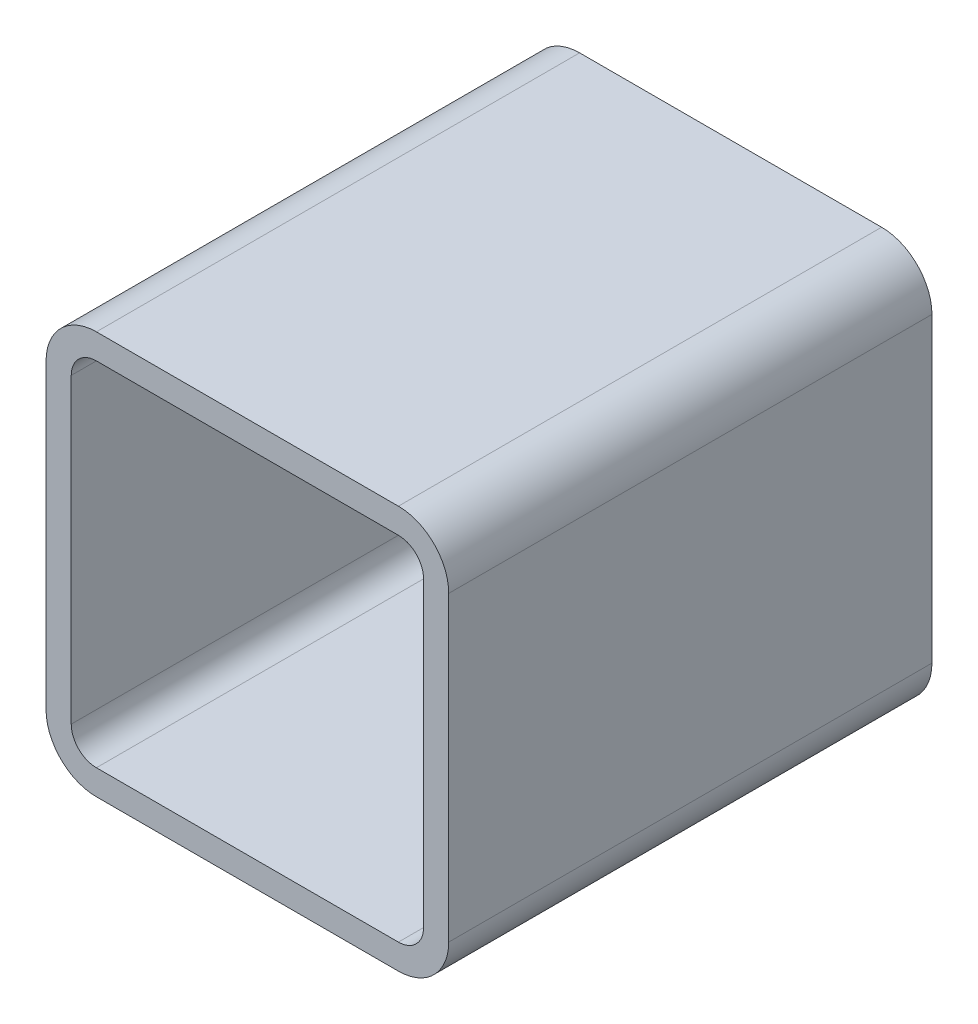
ISO-10303-21;
HEADER;
FILE_DESCRIPTION(('STEP AP214'),'2;1');
FILE_NAME('part.step','',(''),(''),'','','');
FILE_SCHEMA(('AUTOMOTIVE_DESIGN { 1 0 10303 214 1 1 1 1 }'));
ENDSEC;
DATA;
#1=APPLICATION_CONTEXT('core data for automotive mechanical design processes');
#2=APPLICATION_PROTOCOL_DEFINITION('international standard','automotive_design',2000,#1);
#3=PRODUCT_CONTEXT('',#1,'mechanical');
#4=PRODUCT('Part','Part','',(#3));
#5=PRODUCT_RELATED_PRODUCT_CATEGORY('part','',(#4));
#6=PRODUCT_DEFINITION_FORMATION('','',#4);
#7=PRODUCT_DEFINITION_CONTEXT('part definition',#1,'design');
#8=PRODUCT_DEFINITION('design','',#6,#7);
#9=PRODUCT_DEFINITION_SHAPE('','',#8);
#10=(LENGTH_UNIT() NAMED_UNIT(*) SI_UNIT(.MILLI.,.METRE.));
#11=(NAMED_UNIT(*) PLANE_ANGLE_UNIT() SI_UNIT($,.RADIAN.));
#12=(NAMED_UNIT(*) SI_UNIT($,.STERADIAN.) SOLID_ANGLE_UNIT());
#13=UNCERTAINTY_MEASURE_WITH_UNIT(LENGTH_MEASURE(1.E-05),#10,'distance_accuracy_value','');
#14=(GEOMETRIC_REPRESENTATION_CONTEXT(3) GLOBAL_UNCERTAINTY_ASSIGNED_CONTEXT((#13)) GLOBAL_UNIT_ASSIGNED_CONTEXT((#10,
#11,#12)) REPRESENTATION_CONTEXT('',''));
#15=CARTESIAN_POINT('',(0.,0.,0.));
#16=DIRECTION('',(0.,0.,1.));
#17=DIRECTION('',(1.,0.,0.));
#18=AXIS2_PLACEMENT_3D('',#15,#16,#17);
#19=CARTESIAN_POINT('',(34.4845794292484,224.170313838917,304.8));
#20=DIRECTION('',(0.,0.,1.));
#21=DIRECTION('',(1.,0.,0.));
#22=AXIS2_PLACEMENT_3D('',#19,#20,#21);
#23=PLANE('',#22);
#24=CARTESIAN_POINT('',(34.4845794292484,224.170313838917,304.8));
#25=DIRECTION('',(0.,0.,1.));
#26=DIRECTION('',(1.,0.,0.));
#27=AXIS2_PLACEMENT_3D('',#24,#25,#26);
#28=CIRCLE('',#27,31.75);
#29=CARTESIAN_POINT('',(34.4845794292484,255.920313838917,304.8));
#30=VERTEX_POINT('',#29);
#31=CARTESIAN_POINT('',(2.73457942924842,224.170313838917,304.8));
#32=VERTEX_POINT('',#31);
#33=EDGE_CURVE('E211',#30,#32,#28,.T.);
#34=ORIENTED_EDGE('',*,*,#33,.T.);
#35=DIRECTION('',(0.,-1.,0.));
#36=VECTOR('',#35,1.);
#37=CARTESIAN_POINT('',(2.73457942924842,33.6703138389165,304.8));
#38=LINE('',#37,#36);
#39=CARTESIAN_POINT('',(2.73457942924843,33.6703138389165,304.8));
#40=VERTEX_POINT('',#39);
#41=EDGE_CURVE('E214',#32,#40,#38,.T.);
#42=ORIENTED_EDGE('',*,*,#41,.T.);
#43=CARTESIAN_POINT('',(34.4845794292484,33.6703138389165,304.8));
#44=DIRECTION('',(0.,0.,1.));
#45=DIRECTION('',(1.,0.,0.));
#46=AXIS2_PLACEMENT_3D('',#43,#44,#45);
#47=CIRCLE('',#46,31.75);
#48=CARTESIAN_POINT('',(34.4845794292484,1.92031383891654,304.8));
#49=VERTEX_POINT('',#48);
#50=EDGE_CURVE('E217',#40,#49,#47,.T.);
#51=ORIENTED_EDGE('',*,*,#50,.T.);
#52=DIRECTION('',(1.,0.,0.));
#53=VECTOR('',#52,1.);
#54=CARTESIAN_POINT('',(224.984579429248,1.92031383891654,304.8));
#55=LINE('',#54,#53);
#56=CARTESIAN_POINT('',(224.984579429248,1.92031383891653,304.8));
#57=VERTEX_POINT('',#56);
#58=EDGE_CURVE('E219',#49,#57,#55,.T.);
#59=ORIENTED_EDGE('',*,*,#58,.T.);
#60=CARTESIAN_POINT('',(224.984579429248,33.6703138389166,304.8));
#61=DIRECTION('',(0.,0.,1.));
#62=DIRECTION('',(1.,0.,0.));
#63=AXIS2_PLACEMENT_3D('',#60,#61,#62);
#64=CIRCLE('',#63,31.75);
#65=CARTESIAN_POINT('',(256.734579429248,33.6703138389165,304.8));
#66=VERTEX_POINT('',#65);
#67=EDGE_CURVE('E221',#57,#66,#64,.T.);
#68=ORIENTED_EDGE('',*,*,#67,.T.);
#69=DIRECTION('',(0.,1.,0.));
#70=VECTOR('',#69,1.);
#71=CARTESIAN_POINT('',(256.734579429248,224.170313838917,304.8));
#72=LINE('',#71,#70);
#73=CARTESIAN_POINT('',(256.734579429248,224.170313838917,304.8));
#74=VERTEX_POINT('',#73);
#75=EDGE_CURVE('E223',#66,#74,#72,.T.);
#76=ORIENTED_EDGE('',*,*,#75,.T.);
#77=CARTESIAN_POINT('',(224.984579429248,224.170313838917,304.8));
#78=DIRECTION('',(0.,0.,1.));
#79=DIRECTION('',(1.,0.,0.));
#80=AXIS2_PLACEMENT_3D('',#77,#78,#79);
#81=CIRCLE('',#80,31.75);
#82=CARTESIAN_POINT('',(224.984579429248,255.920313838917,304.8));
#83=VERTEX_POINT('',#82);
#84=EDGE_CURVE('E225',#74,#83,#81,.T.);
#85=ORIENTED_EDGE('',*,*,#84,.T.);
#86=DIRECTION('',(-1.,0.,0.));
#87=VECTOR('',#86,1.);
#88=CARTESIAN_POINT('',(34.4845794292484,255.920313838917,304.8));
#89=LINE('',#88,#87);
#90=EDGE_CURVE('E227',#83,#30,#89,.T.);
#91=ORIENTED_EDGE('',*,*,#90,.T.);
#92=EDGE_LOOP('',(#34,#42,#51,#59,#68,#76,#85,#91));
#93=FACE_BOUND('',#92,.T.);
#94=DIRECTION('',(0.,-1.,0.));
#95=VECTOR('',#94,1.);
#96=CARTESIAN_POINT('',(18.6095794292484,33.6703138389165,304.8));
#97=LINE('',#96,#95);
#98=CARTESIAN_POINT('',(18.6095794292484,224.170313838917,304.8));
#99=VERTEX_POINT('',#98);
#100=CARTESIAN_POINT('',(18.6095794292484,33.6703138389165,304.8));
#101=VERTEX_POINT('',#100);
#102=EDGE_CURVE('E154',#99,#101,#97,.T.);
#103=ORIENTED_EDGE('',*,*,#102,.F.);
#104=CARTESIAN_POINT('',(34.4845794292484,224.170313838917,304.8));
#105=DIRECTION('',(0.,0.,1.));
#106=DIRECTION('',(1.,0.,0.));
#107=AXIS2_PLACEMENT_3D('',#104,#105,#106);
#108=CIRCLE('',#107,15.875);
#109=CARTESIAN_POINT('',(34.4845794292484,240.045313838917,304.8));
#110=VERTEX_POINT('',#109);
#111=EDGE_CURVE('E146',#110,#99,#108,.T.);
#112=ORIENTED_EDGE('',*,*,#111,.F.);
#113=DIRECTION('',(-1.,0.,0.));
#114=VECTOR('',#113,1.);
#115=CARTESIAN_POINT('',(34.4845794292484,240.045313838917,304.8));
#116=LINE('',#115,#114);
#117=CARTESIAN_POINT('',(224.984579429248,240.045313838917,304.8));
#118=VERTEX_POINT('',#117);
#119=EDGE_CURVE('E179',#118,#110,#116,.T.);
#120=ORIENTED_EDGE('',*,*,#119,.F.);
#121=CARTESIAN_POINT('',(224.984579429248,224.170313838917,304.8));
#122=DIRECTION('',(0.,0.,1.));
#123=DIRECTION('',(1.,0.,0.));
#124=AXIS2_PLACEMENT_3D('',#121,#122,#123);
#125=CIRCLE('',#124,15.875);
#126=CARTESIAN_POINT('',(240.859579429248,224.170313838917,304.8));
#127=VERTEX_POINT('',#126);
#128=EDGE_CURVE('E177',#127,#118,#125,.T.);
#129=ORIENTED_EDGE('',*,*,#128,.F.);
#130=DIRECTION('',(0.,1.,0.));
#131=VECTOR('',#130,1.);
#132=CARTESIAN_POINT('',(240.859579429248,224.170313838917,304.8));
#133=LINE('',#132,#131);
#134=CARTESIAN_POINT('',(240.859579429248,33.6703138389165,304.8));
#135=VERTEX_POINT('',#134);
#136=EDGE_CURVE('E175',#135,#127,#133,.T.);
#137=ORIENTED_EDGE('',*,*,#136,.F.);
#138=CARTESIAN_POINT('',(224.984579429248,33.6703138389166,304.8));
#139=DIRECTION('',(0.,0.,1.));
#140=DIRECTION('',(1.,0.,0.));
#141=AXIS2_PLACEMENT_3D('',#138,#139,#140);
#142=CIRCLE('',#141,15.875);
#143=CARTESIAN_POINT('',(224.984579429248,17.7953138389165,304.8));
#144=VERTEX_POINT('',#143);
#145=EDGE_CURVE('E173',#144,#135,#142,.T.);
#146=ORIENTED_EDGE('',*,*,#145,.F.);
#147=DIRECTION('',(1.,0.,0.));
#148=VECTOR('',#147,1.);
#149=CARTESIAN_POINT('',(224.984579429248,17.7953138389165,304.8));
#150=LINE('',#149,#148);
#151=CARTESIAN_POINT('',(34.4845794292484,17.7953138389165,304.8));
#152=VERTEX_POINT('',#151);
#153=EDGE_CURVE('E169',#152,#144,#150,.T.);
#154=ORIENTED_EDGE('',*,*,#153,.F.);
#155=CARTESIAN_POINT('',(34.4845794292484,33.6703138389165,304.8));
#156=DIRECTION('',(0.,0.,1.));
#157=DIRECTION('',(1.,0.,0.));
#158=AXIS2_PLACEMENT_3D('',#155,#156,#157);
#159=CIRCLE('',#158,15.875);
#160=EDGE_CURVE('E167',#101,#152,#159,.T.);
#161=ORIENTED_EDGE('',*,*,#160,.F.);
#162=EDGE_LOOP('',(#103,#112,#120,#129,#137,#146,#154,#161));
#163=FACE_BOUND('',#162,.T.);
#164=ADVANCED_FACE('F33',(#93,#163),#23,.T.);
#165=CARTESIAN_POINT('',(34.4845794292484,224.170313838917,0.));
#166=DIRECTION('',(0.,0.,1.));
#167=DIRECTION('',(1.,0.,0.));
#168=AXIS2_PLACEMENT_3D('',#165,#166,#167);
#169=PLANE('',#168);
#170=CARTESIAN_POINT('',(34.4845794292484,224.170313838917,0.));
#171=DIRECTION('',(0.,0.,1.));
#172=DIRECTION('',(1.,0.,0.));
#173=AXIS2_PLACEMENT_3D('',#170,#171,#172);
#174=CIRCLE('',#173,31.75);
#175=CARTESIAN_POINT('',(34.4845794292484,255.920313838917,0.));
#176=VERTEX_POINT('',#175);
#177=CARTESIAN_POINT('',(2.73457942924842,224.170313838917,0.));
#178=VERTEX_POINT('',#177);
#179=EDGE_CURVE('E162',#176,#178,#174,.T.);
#180=ORIENTED_EDGE('',*,*,#179,.F.);
#181=DIRECTION('',(-1.,0.,0.));
#182=VECTOR('',#181,1.);
#183=CARTESIAN_POINT('',(34.4845794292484,255.920313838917,0.));
#184=LINE('',#183,#182);
#185=CARTESIAN_POINT('',(224.984579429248,255.920313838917,0.));
#186=VERTEX_POINT('',#185);
#187=EDGE_CURVE('E215',#186,#176,#184,.T.);
#188=ORIENTED_EDGE('',*,*,#187,.F.);
#189=CARTESIAN_POINT('',(224.984579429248,224.170313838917,0.));
#190=DIRECTION('',(0.,0.,1.));
#191=DIRECTION('',(1.,0.,0.));
#192=AXIS2_PLACEMENT_3D('',#189,#190,#191);
#193=CIRCLE('',#192,31.75);
#194=CARTESIAN_POINT('',(256.734579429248,224.170313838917,0.));
#195=VERTEX_POINT('',#194);
#196=EDGE_CURVE('E242',#195,#186,#193,.T.);
#197=ORIENTED_EDGE('',*,*,#196,.F.);
#198=DIRECTION('',(0.,1.,0.));
#199=VECTOR('',#198,1.);
#200=CARTESIAN_POINT('',(256.734579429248,224.170313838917,0.));
#201=LINE('',#200,#199);
#202=CARTESIAN_POINT('',(256.734579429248,33.6703138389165,0.));
#203=VERTEX_POINT('',#202);
#204=EDGE_CURVE('E240',#203,#195,#201,.T.);
#205=ORIENTED_EDGE('',*,*,#204,.F.);
#206=CARTESIAN_POINT('',(224.984579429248,33.6703138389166,0.));
#207=DIRECTION('',(0.,0.,1.));
#208=DIRECTION('',(1.,0.,0.));
#209=AXIS2_PLACEMENT_3D('',#206,#207,#208);
#210=CIRCLE('',#209,31.75);
#211=CARTESIAN_POINT('',(224.984579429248,1.92031383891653,0.));
#212=VERTEX_POINT('',#211);
#213=EDGE_CURVE('E238',#212,#203,#210,.T.);
#214=ORIENTED_EDGE('',*,*,#213,.F.);
#215=DIRECTION('',(1.,0.,0.));
#216=VECTOR('',#215,1.);
#217=CARTESIAN_POINT('',(224.984579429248,1.92031383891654,0.));
#218=LINE('',#217,#216);
#219=CARTESIAN_POINT('',(34.4845794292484,1.92031383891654,0.));
#220=VERTEX_POINT('',#219);
#221=EDGE_CURVE('E236',#220,#212,#218,.T.);
#222=ORIENTED_EDGE('',*,*,#221,.F.);
#223=CARTESIAN_POINT('',(34.4845794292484,33.6703138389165,0.));
#224=DIRECTION('',(0.,0.,1.));
#225=DIRECTION('',(1.,0.,0.));
#226=AXIS2_PLACEMENT_3D('',#223,#224,#225);
#227=CIRCLE('',#226,31.75);
#228=CARTESIAN_POINT('',(2.73457942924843,33.6703138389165,0.));
#229=VERTEX_POINT('',#228);
#230=EDGE_CURVE('E234',#229,#220,#227,.T.);
#231=ORIENTED_EDGE('',*,*,#230,.F.);
#232=DIRECTION('',(0.,-1.,0.));
#233=VECTOR('',#232,1.);
#234=CARTESIAN_POINT('',(2.73457942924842,33.6703138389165,0.));
#235=LINE('',#234,#233);
#236=EDGE_CURVE('E232',#178,#229,#235,.T.);
#237=ORIENTED_EDGE('',*,*,#236,.F.);
#238=EDGE_LOOP('',(#180,#188,#197,#205,#214,#222,#231,#237));
#239=FACE_BOUND('',#238,.T.);
#240=CARTESIAN_POINT('',(34.4845794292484,224.170313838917,0.));
#241=DIRECTION('',(0.,0.,1.));
#242=DIRECTION('',(1.,0.,0.));
#243=AXIS2_PLACEMENT_3D('',#240,#241,#242);
#244=CIRCLE('',#243,15.875);
#245=CARTESIAN_POINT('',(34.4845794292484,240.045313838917,0.));
#246=VERTEX_POINT('',#245);
#247=CARTESIAN_POINT('',(18.6095794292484,224.170313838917,0.));
#248=VERTEX_POINT('',#247);
#249=EDGE_CURVE('E56',#246,#248,#244,.T.);
#250=ORIENTED_EDGE('',*,*,#249,.T.);
#251=DIRECTION('',(0.,-1.,0.));
#252=VECTOR('',#251,1.);
#253=CARTESIAN_POINT('',(18.6095794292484,33.6703138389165,0.));
#254=LINE('',#253,#252);
#255=CARTESIAN_POINT('',(18.6095794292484,33.6703138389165,0.));
#256=VERTEX_POINT('',#255);
#257=EDGE_CURVE('E161',#248,#256,#254,.T.);
#258=ORIENTED_EDGE('',*,*,#257,.T.);
#259=CARTESIAN_POINT('',(34.4845794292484,33.6703138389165,0.));
#260=DIRECTION('',(0.,0.,1.));
#261=DIRECTION('',(1.,0.,0.));
#262=AXIS2_PLACEMENT_3D('',#259,#260,#261);
#263=CIRCLE('',#262,15.875);
#264=CARTESIAN_POINT('',(34.4845794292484,17.7953138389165,0.));
#265=VERTEX_POINT('',#264);
#266=EDGE_CURVE('E183',#256,#265,#263,.T.);
#267=ORIENTED_EDGE('',*,*,#266,.T.);
#268=DIRECTION('',(1.,0.,0.));
#269=VECTOR('',#268,1.);
#270=CARTESIAN_POINT('',(224.984579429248,17.7953138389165,0.));
#271=LINE('',#270,#269);
#272=CARTESIAN_POINT('',(224.984579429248,17.7953138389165,0.));
#273=VERTEX_POINT('',#272);
#274=EDGE_CURVE('E186',#265,#273,#271,.T.);
#275=ORIENTED_EDGE('',*,*,#274,.T.);
#276=CARTESIAN_POINT('',(224.984579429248,33.6703138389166,0.));
#277=DIRECTION('',(0.,0.,1.));
#278=DIRECTION('',(1.,0.,0.));
#279=AXIS2_PLACEMENT_3D('',#276,#277,#278);
#280=CIRCLE('',#279,15.875);
#281=CARTESIAN_POINT('',(240.859579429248,33.6703138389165,0.));
#282=VERTEX_POINT('',#281);
#283=EDGE_CURVE('E189',#273,#282,#280,.T.);
#284=ORIENTED_EDGE('',*,*,#283,.T.);
#285=DIRECTION('',(0.,1.,0.));
#286=VECTOR('',#285,1.);
#287=CARTESIAN_POINT('',(240.859579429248,224.170313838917,0.));
#288=LINE('',#287,#286);
#289=CARTESIAN_POINT('',(240.859579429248,224.170313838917,0.));
#290=VERTEX_POINT('',#289);
#291=EDGE_CURVE('E192',#282,#290,#288,.T.);
#292=ORIENTED_EDGE('',*,*,#291,.T.);
#293=CARTESIAN_POINT('',(224.984579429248,224.170313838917,0.));
#294=DIRECTION('',(0.,0.,1.));
#295=DIRECTION('',(1.,0.,0.));
#296=AXIS2_PLACEMENT_3D('',#293,#294,#295);
#297=CIRCLE('',#296,15.875);
#298=CARTESIAN_POINT('',(224.984579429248,240.045313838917,0.));
#299=VERTEX_POINT('',#298);
#300=EDGE_CURVE('E195',#290,#299,#297,.T.);
#301=ORIENTED_EDGE('',*,*,#300,.T.);
#302=DIRECTION('',(-1.,0.,0.));
#303=VECTOR('',#302,1.);
#304=CARTESIAN_POINT('',(34.4845794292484,240.045313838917,0.));
#305=LINE('',#304,#303);
#306=EDGE_CURVE('E155',#299,#246,#305,.T.);
#307=ORIENTED_EDGE('',*,*,#306,.T.);
#308=EDGE_LOOP('',(#250,#258,#267,#275,#284,#292,#301,#307));
#309=FACE_BOUND('',#308,.T.);
#310=ADVANCED_FACE('F272',(#239,#309),#169,.F.);
#311=CARTESIAN_POINT('',(34.4845794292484,224.170313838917,304.8));
#312=DIRECTION('',(0.,0.,-1.));
#313=DIRECTION('',(-1.,0.,0.));
#314=AXIS2_PLACEMENT_3D('',#311,#312,#313);
#315=CYLINDRICAL_SURFACE('',#314,31.75);
#316=ORIENTED_EDGE('',*,*,#179,.T.);
#317=DIRECTION('',(0.,0.,-1.));
#318=VECTOR('',#317,1.);
#319=CARTESIAN_POINT('',(2.73457942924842,224.170313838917,304.8));
#320=LINE('',#319,#318);
#321=EDGE_CURVE('E11',#32,#178,#320,.T.);
#322=ORIENTED_EDGE('',*,*,#321,.F.);
#323=ORIENTED_EDGE('',*,*,#33,.F.);
#324=DIRECTION('',(0.,0.,-1.));
#325=VECTOR('',#324,1.);
#326=CARTESIAN_POINT('',(34.4845794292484,255.920313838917,304.8));
#327=LINE('',#326,#325);
#328=EDGE_CURVE('E229',#30,#176,#327,.T.);
#329=ORIENTED_EDGE('',*,*,#328,.T.);
#330=EDGE_LOOP('',(#316,#322,#323,#329));
#331=FACE_BOUND('',#330,.T.);
#332=ADVANCED_FACE('F35',(#331),#315,.T.);
#333=CARTESIAN_POINT('',(2.73457942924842,33.6703138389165,304.8));
#334=DIRECTION('',(1.,0.,0.));
#335=DIRECTION('',(0.,0.,-1.));
#336=AXIS2_PLACEMENT_3D('',#333,#334,#335);
#337=PLANE('',#336);
#338=ORIENTED_EDGE('',*,*,#236,.T.);
#339=DIRECTION('',(0.,0.,-1.));
#340=VECTOR('',#339,1.);
#341=CARTESIAN_POINT('',(2.73457942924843,33.6703138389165,304.8));
#342=LINE('',#341,#340);
#343=EDGE_CURVE('E41',#40,#229,#342,.T.);
#344=ORIENTED_EDGE('',*,*,#343,.F.);
#345=ORIENTED_EDGE('',*,*,#41,.F.);
#346=ORIENTED_EDGE('',*,*,#321,.T.);
#347=EDGE_LOOP('',(#338,#344,#345,#346));
#348=FACE_BOUND('',#347,.T.);
#349=ADVANCED_FACE('F289',(#348),#337,.F.);
#350=CARTESIAN_POINT('',(34.4845794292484,33.6703138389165,304.8));
#351=DIRECTION('',(0.,0.,-1.));
#352=DIRECTION('',(-1.,0.,0.));
#353=AXIS2_PLACEMENT_3D('',#350,#351,#352);
#354=CYLINDRICAL_SURFACE('',#353,31.75);
#355=ORIENTED_EDGE('',*,*,#230,.T.);
#356=DIRECTION('',(0.,0.,-1.));
#357=VECTOR('',#356,1.);
#358=CARTESIAN_POINT('',(34.4845794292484,1.92031383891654,304.8));
#359=LINE('',#358,#357);
#360=EDGE_CURVE('E259',#49,#220,#359,.T.);
#361=ORIENTED_EDGE('',*,*,#360,.F.);
#362=ORIENTED_EDGE('',*,*,#50,.F.);
#363=ORIENTED_EDGE('',*,*,#343,.T.);
#364=EDGE_LOOP('',(#355,#361,#362,#363));
#365=FACE_BOUND('',#364,.T.);
#366=ADVANCED_FACE('F266',(#365),#354,.T.);
#367=CARTESIAN_POINT('',(224.984579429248,1.92031383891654,304.8));
#368=DIRECTION('',(0.,1.,0.));
#369=DIRECTION('',(0.,0.,1.));
#370=AXIS2_PLACEMENT_3D('',#367,#368,#369);
#371=PLANE('',#370);
#372=ORIENTED_EDGE('',*,*,#221,.T.);
#373=DIRECTION('',(0.,0.,-1.));
#374=VECTOR('',#373,1.);
#375=CARTESIAN_POINT('',(224.984579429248,1.92031383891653,304.8));
#376=LINE('',#375,#374);
#377=EDGE_CURVE('E256',#57,#212,#376,.T.);
#378=ORIENTED_EDGE('',*,*,#377,.F.);
#379=ORIENTED_EDGE('',*,*,#58,.F.);
#380=ORIENTED_EDGE('',*,*,#360,.T.);
#381=EDGE_LOOP('',(#372,#378,#379,#380));
#382=FACE_BOUND('',#381,.T.);
#383=ADVANCED_FACE('F278',(#382),#371,.F.);
#384=CARTESIAN_POINT('',(224.984579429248,33.6703138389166,304.8));
#385=DIRECTION('',(0.,0.,-1.));
#386=DIRECTION('',(-1.,0.,0.));
#387=AXIS2_PLACEMENT_3D('',#384,#385,#386);
#388=CYLINDRICAL_SURFACE('',#387,31.75);
#389=ORIENTED_EDGE('',*,*,#213,.T.);
#390=DIRECTION('',(0.,0.,-1.));
#391=VECTOR('',#390,1.);
#392=CARTESIAN_POINT('',(256.734579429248,33.6703138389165,304.8));
#393=LINE('',#392,#391);
#394=EDGE_CURVE('E253',#66,#203,#393,.T.);
#395=ORIENTED_EDGE('',*,*,#394,.F.);
#396=ORIENTED_EDGE('',*,*,#67,.F.);
#397=ORIENTED_EDGE('',*,*,#377,.T.);
#398=EDGE_LOOP('',(#389,#395,#396,#397));
#399=FACE_BOUND('',#398,.T.);
#400=ADVANCED_FACE('F282',(#399),#388,.T.);
#401=CARTESIAN_POINT('',(256.734579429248,224.170313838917,304.8));
#402=DIRECTION('',(-1.,0.,0.));
#403=DIRECTION('',(0.,0.,1.));
#404=AXIS2_PLACEMENT_3D('',#401,#402,#403);
#405=PLANE('',#404);
#406=ORIENTED_EDGE('',*,*,#204,.T.);
#407=DIRECTION('',(0.,0.,-1.));
#408=VECTOR('',#407,1.);
#409=CARTESIAN_POINT('',(256.734579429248,224.170313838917,304.8));
#410=LINE('',#409,#408);
#411=EDGE_CURVE('E250',#74,#195,#410,.T.);
#412=ORIENTED_EDGE('',*,*,#411,.F.);
#413=ORIENTED_EDGE('',*,*,#75,.F.);
#414=ORIENTED_EDGE('',*,*,#394,.T.);
#415=EDGE_LOOP('',(#406,#412,#413,#414));
#416=FACE_BOUND('',#415,.T.);
#417=ADVANCED_FACE('F302',(#416),#405,.F.);
#418=CARTESIAN_POINT('',(224.984579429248,224.170313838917,304.8));
#419=DIRECTION('',(0.,0.,-1.));
#420=DIRECTION('',(-1.,0.,0.));
#421=AXIS2_PLACEMENT_3D('',#418,#419,#420);
#422=CYLINDRICAL_SURFACE('',#421,31.75);
#423=ORIENTED_EDGE('',*,*,#196,.T.);
#424=DIRECTION('',(0.,0.,-1.));
#425=VECTOR('',#424,1.);
#426=CARTESIAN_POINT('',(224.984579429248,255.920313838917,304.8));
#427=LINE('',#426,#425);
#428=EDGE_CURVE('E247',#83,#186,#427,.T.);
#429=ORIENTED_EDGE('',*,*,#428,.F.);
#430=ORIENTED_EDGE('',*,*,#84,.F.);
#431=ORIENTED_EDGE('',*,*,#411,.T.);
#432=EDGE_LOOP('',(#423,#429,#430,#431));
#433=FACE_BOUND('',#432,.T.);
#434=ADVANCED_FACE('F300',(#433),#422,.T.);
#435=CARTESIAN_POINT('',(34.4845794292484,255.920313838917,304.8));
#436=DIRECTION('',(0.,-1.,0.));
#437=DIRECTION('',(0.,0.,-1.));
#438=AXIS2_PLACEMENT_3D('',#435,#436,#437);
#439=PLANE('',#438);
#440=ORIENTED_EDGE('',*,*,#187,.T.);
#441=ORIENTED_EDGE('',*,*,#328,.F.);
#442=ORIENTED_EDGE('',*,*,#90,.F.);
#443=ORIENTED_EDGE('',*,*,#428,.T.);
#444=EDGE_LOOP('',(#440,#441,#442,#443));
#445=FACE_BOUND('',#444,.T.);
#446=ADVANCED_FACE('F295',(#445),#439,.F.);
#447=CARTESIAN_POINT('',(34.4845794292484,224.170313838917,304.8));
#448=DIRECTION('',(0.,0.,-1.));
#449=DIRECTION('',(-1.,0.,0.));
#450=AXIS2_PLACEMENT_3D('',#447,#448,#449);
#451=CYLINDRICAL_SURFACE('',#450,15.875);
#452=ORIENTED_EDGE('',*,*,#249,.F.);
#453=DIRECTION('',(0.,0.,-1.));
#454=VECTOR('',#453,1.);
#455=CARTESIAN_POINT('',(34.4845794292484,240.045313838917,304.8));
#456=LINE('',#455,#454);
#457=EDGE_CURVE('E150',#110,#246,#456,.T.);
#458=ORIENTED_EDGE('',*,*,#457,.F.);
#459=ORIENTED_EDGE('',*,*,#111,.T.);
#460=DIRECTION('',(0.,0.,-1.));
#461=VECTOR('',#460,1.);
#462=CARTESIAN_POINT('',(18.6095794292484,224.170313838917,304.8));
#463=LINE('',#462,#461);
#464=EDGE_CURVE('E149',#99,#248,#463,.T.);
#465=ORIENTED_EDGE('',*,*,#464,.T.);
#466=EDGE_LOOP('',(#452,#458,#459,#465));
#467=FACE_BOUND('',#466,.T.);
#468=ADVANCED_FACE('F148',(#467),#451,.F.);
#469=CARTESIAN_POINT('',(18.6095794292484,33.6703138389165,304.8));
#470=DIRECTION('',(1.,0.,0.));
#471=DIRECTION('',(0.,0.,-1.));
#472=AXIS2_PLACEMENT_3D('',#469,#470,#471);
#473=PLANE('',#472);
#474=ORIENTED_EDGE('',*,*,#257,.F.);
#475=ORIENTED_EDGE('',*,*,#464,.F.);
#476=ORIENTED_EDGE('',*,*,#102,.T.);
#477=DIRECTION('',(0.,0.,-1.));
#478=VECTOR('',#477,1.);
#479=CARTESIAN_POINT('',(18.6095794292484,33.6703138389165,304.8));
#480=LINE('',#479,#478);
#481=EDGE_CURVE('E163',#101,#256,#480,.T.);
#482=ORIENTED_EDGE('',*,*,#481,.T.);
#483=EDGE_LOOP('',(#474,#475,#476,#482));
#484=FACE_BOUND('',#483,.T.);
#485=ADVANCED_FACE('F158',(#484),#473,.T.);
#486=CARTESIAN_POINT('',(34.4845794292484,33.6703138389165,304.8));
#487=DIRECTION('',(0.,0.,-1.));
#488=DIRECTION('',(-1.,0.,0.));
#489=AXIS2_PLACEMENT_3D('',#486,#487,#488);
#490=CYLINDRICAL_SURFACE('',#489,15.875);
#491=ORIENTED_EDGE('',*,*,#266,.F.);
#492=ORIENTED_EDGE('',*,*,#481,.F.);
#493=ORIENTED_EDGE('',*,*,#160,.T.);
#494=DIRECTION('',(0.,0.,-1.));
#495=VECTOR('',#494,1.);
#496=CARTESIAN_POINT('',(34.4845794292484,17.7953138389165,304.8));
#497=LINE('',#496,#495);
#498=EDGE_CURVE('E208',#152,#265,#497,.T.);
#499=ORIENTED_EDGE('',*,*,#498,.T.);
#500=EDGE_LOOP('',(#491,#492,#493,#499));
#501=FACE_BOUND('',#500,.T.);
#502=ADVANCED_FACE('F327',(#501),#490,.F.);
#503=CARTESIAN_POINT('',(224.984579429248,17.7953138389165,304.8));
#504=DIRECTION('',(0.,1.,0.));
#505=DIRECTION('',(0.,0.,1.));
#506=AXIS2_PLACEMENT_3D('',#503,#504,#505);
#507=PLANE('',#506);
#508=ORIENTED_EDGE('',*,*,#274,.F.);
#509=ORIENTED_EDGE('',*,*,#498,.F.);
#510=ORIENTED_EDGE('',*,*,#153,.T.);
#511=DIRECTION('',(0.,0.,-1.));
#512=VECTOR('',#511,1.);
#513=CARTESIAN_POINT('',(224.984579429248,17.7953138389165,304.8));
#514=LINE('',#513,#512);
#515=EDGE_CURVE('E206',#144,#273,#514,.T.);
#516=ORIENTED_EDGE('',*,*,#515,.T.);
#517=EDGE_LOOP('',(#508,#509,#510,#516));
#518=FACE_BOUND('',#517,.T.);
#519=ADVANCED_FACE('F331',(#518),#507,.T.);
#520=CARTESIAN_POINT('',(224.984579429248,33.6703138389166,304.8));
#521=DIRECTION('',(0.,0.,-1.));
#522=DIRECTION('',(-1.,0.,0.));
#523=AXIS2_PLACEMENT_3D('',#520,#521,#522);
#524=CYLINDRICAL_SURFACE('',#523,15.875);
#525=ORIENTED_EDGE('',*,*,#283,.F.);
#526=ORIENTED_EDGE('',*,*,#515,.F.);
#527=ORIENTED_EDGE('',*,*,#145,.T.);
#528=DIRECTION('',(0.,0.,-1.));
#529=VECTOR('',#528,1.);
#530=CARTESIAN_POINT('',(240.859579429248,33.6703138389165,304.8));
#531=LINE('',#530,#529);
#532=EDGE_CURVE('E204',#135,#282,#531,.T.);
#533=ORIENTED_EDGE('',*,*,#532,.T.);
#534=EDGE_LOOP('',(#525,#526,#527,#533));
#535=FACE_BOUND('',#534,.T.);
#536=ADVANCED_FACE('F337',(#535),#524,.F.);
#537=CARTESIAN_POINT('',(240.859579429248,224.170313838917,304.8));
#538=DIRECTION('',(-1.,0.,0.));
#539=DIRECTION('',(0.,0.,1.));
#540=AXIS2_PLACEMENT_3D('',#537,#538,#539);
#541=PLANE('',#540);
#542=ORIENTED_EDGE('',*,*,#291,.F.);
#543=ORIENTED_EDGE('',*,*,#532,.F.);
#544=ORIENTED_EDGE('',*,*,#136,.T.);
#545=DIRECTION('',(0.,0.,-1.));
#546=VECTOR('',#545,1.);
#547=CARTESIAN_POINT('',(240.859579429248,224.170313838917,304.8));
#548=LINE('',#547,#546);
#549=EDGE_CURVE('E202',#127,#290,#548,.T.);
#550=ORIENTED_EDGE('',*,*,#549,.T.);
#551=EDGE_LOOP('',(#542,#543,#544,#550));
#552=FACE_BOUND('',#551,.T.);
#553=ADVANCED_FACE('F341',(#552),#541,.T.);
#554=CARTESIAN_POINT('',(224.984579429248,224.170313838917,304.8));
#555=DIRECTION('',(0.,0.,-1.));
#556=DIRECTION('',(-1.,0.,0.));
#557=AXIS2_PLACEMENT_3D('',#554,#555,#556);
#558=CYLINDRICAL_SURFACE('',#557,15.875);
#559=ORIENTED_EDGE('',*,*,#300,.F.);
#560=ORIENTED_EDGE('',*,*,#549,.F.);
#561=ORIENTED_EDGE('',*,*,#128,.T.);
#562=DIRECTION('',(0.,0.,-1.));
#563=VECTOR('',#562,1.);
#564=CARTESIAN_POINT('',(224.984579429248,240.045313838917,304.8));
#565=LINE('',#564,#563);
#566=EDGE_CURVE('E48',#118,#299,#565,.T.);
#567=ORIENTED_EDGE('',*,*,#566,.T.);
#568=EDGE_LOOP('',(#559,#560,#561,#567));
#569=FACE_BOUND('',#568,.T.);
#570=ADVANCED_FACE('F345',(#569),#558,.F.);
#571=CARTESIAN_POINT('',(34.4845794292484,240.045313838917,304.8));
#572=DIRECTION('',(0.,-1.,0.));
#573=DIRECTION('',(0.,0.,-1.));
#574=AXIS2_PLACEMENT_3D('',#571,#572,#573);
#575=PLANE('',#574);
#576=ORIENTED_EDGE('',*,*,#306,.F.);
#577=ORIENTED_EDGE('',*,*,#566,.F.);
#578=ORIENTED_EDGE('',*,*,#119,.T.);
#579=ORIENTED_EDGE('',*,*,#457,.T.);
#580=EDGE_LOOP('',(#576,#577,#578,#579));
#581=FACE_BOUND('',#580,.T.);
#582=ADVANCED_FACE('F349',(#581),#575,.T.);
#583=CLOSED_SHELL('',(#164,#310,#332,#349,#366,#383,#400,#417,#434,#446,#468,#485,#502,#519,
#536,#553,#570,#582));
#584=MANIFOLD_SOLID_BREP('B2',#583);
#585=ADVANCED_BREP_SHAPE_REPRESENTATION('',(#18,#584),#14);
#586=SHAPE_DEFINITION_REPRESENTATION(#9,#585);
ENDSEC;
END-ISO-10303-21;
